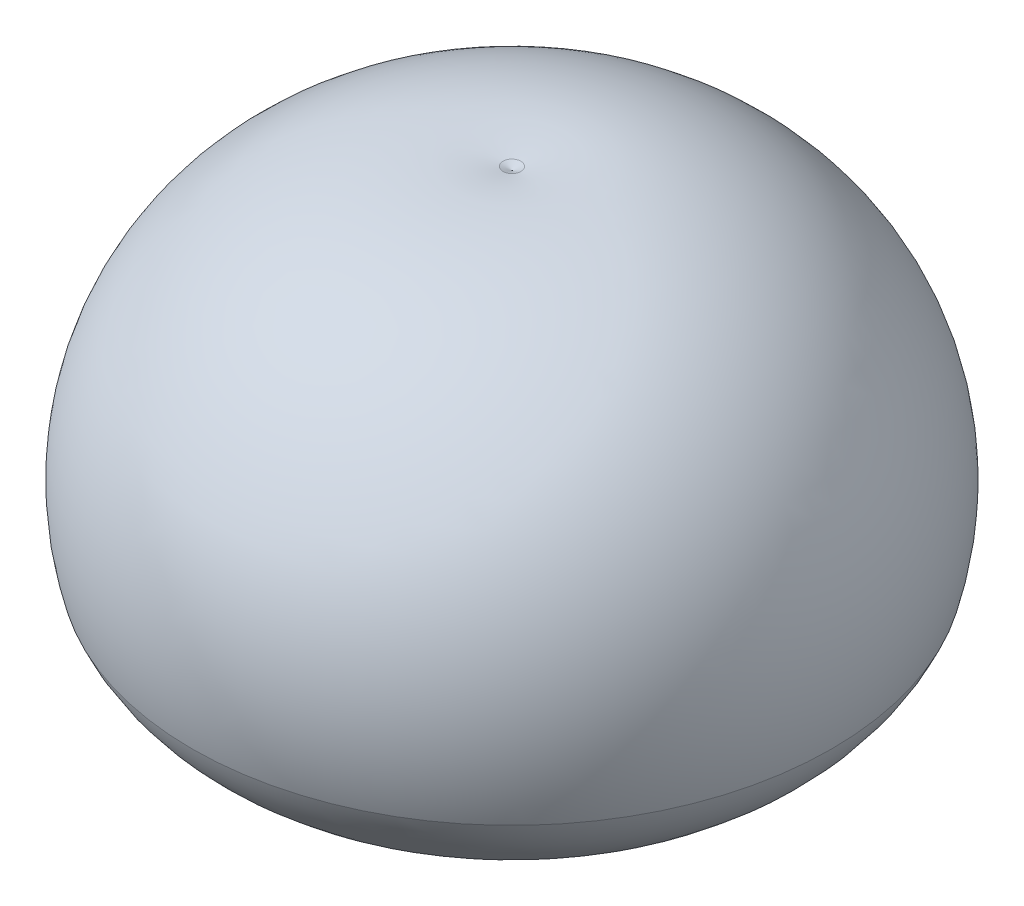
ISO-10303-21;
HEADER;
FILE_DESCRIPTION(('STEP AP214'),'2;1');
FILE_NAME('part.step','',(''),(''),'','','');
FILE_SCHEMA(('AUTOMOTIVE_DESIGN { 1 0 10303 214 1 1 1 1 }'));
ENDSEC;
DATA;
#1=APPLICATION_CONTEXT('core data for automotive mechanical design processes');
#2=APPLICATION_PROTOCOL_DEFINITION('international standard','automotive_design',2000,#1);
#3=PRODUCT_CONTEXT('',#1,'mechanical');
#4=PRODUCT('Part','Part','',(#3));
#5=PRODUCT_RELATED_PRODUCT_CATEGORY('part','',(#4));
#6=PRODUCT_DEFINITION_FORMATION('','',#4);
#7=PRODUCT_DEFINITION_CONTEXT('part definition',#1,'design');
#8=PRODUCT_DEFINITION('design','',#6,#7);
#9=PRODUCT_DEFINITION_SHAPE('','',#8);
#10=(LENGTH_UNIT() NAMED_UNIT(*) SI_UNIT(.MILLI.,.METRE.));
#11=(NAMED_UNIT(*) PLANE_ANGLE_UNIT() SI_UNIT($,.RADIAN.));
#12=(NAMED_UNIT(*) SI_UNIT($,.STERADIAN.) SOLID_ANGLE_UNIT());
#13=UNCERTAINTY_MEASURE_WITH_UNIT(LENGTH_MEASURE(1.E-05),#10,'distance_accuracy_value','');
#14=(GEOMETRIC_REPRESENTATION_CONTEXT(3) GLOBAL_UNCERTAINTY_ASSIGNED_CONTEXT((#13)) GLOBAL_UNIT_ASSIGNED_CONTEXT((#10,
#11,#12)) REPRESENTATION_CONTEXT('',''));
#15=CARTESIAN_POINT('',(0.,0.,0.));
#16=DIRECTION('',(0.,0.,1.));
#17=DIRECTION('',(1.,0.,0.));
#18=AXIS2_PLACEMENT_3D('',#15,#16,#17);
#19=CARTESIAN_POINT('',(356.098188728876,2020.71307667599,0.));
#20=DIRECTION('',(0.,0.,-1.));
#21=DIRECTION('',(1.,0.,0.));
#22=AXIS2_PLACEMENT_3D('',#19,#20,#21);
#23=CIRCLE('',#22,849.999999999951);
#24=TRIMMED_CURVE('',#23,(PARAMETER_VALUE(-2.0030728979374)),(PARAMETER_VALUE(2.0030728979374)),
.T.,.PARAMETER.);
#25=CARTESIAN_POINT('',(-1.66533453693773E-13,2020.71307667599,0.));
#26=DIRECTION('',(0.,-1.,0.));
#27=AXIS1_PLACEMENT('',#25,#26);
#28=SURFACE_OF_REVOLUTION('',#24,#27);
#29=CARTESIAN_POINT('',(-2.1690946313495E-13,2819.45180434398,0.));
#30=DIRECTION('',(0.,-1.,0.));
#31=DIRECTION('',(1.,0.,0.));
#32=AXIS2_PLACEMENT_3D('',#29,#30,#31);
#33=CIRCLE('',#32,65.3810669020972);
#34=CARTESIAN_POINT('',(65.381066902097,2819.45180434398,0.));
#35=VERTEX_POINT('',#34);
#36=EDGE_CURVE('E10',#35,#35,#33,.T.);
#37=ORIENTED_EDGE('',*,*,#36,.F.);
#38=EDGE_LOOP('',(#37));
#39=FACE_BOUND('',#38,.T.);
#40=CARTESIAN_POINT('',(0.,2792.5252818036,0.));
#41=VERTEX_POINT('',#40);
#42=VERTEX_LOOP('',#41);
#43=FACE_BOUND('',#42,.T.);
#44=ADVANCED_FACE('F16',(#39,#43),#28,.T.);
#45=CARTESIAN_POINT('',(0.,830.,0.));
#46=DIRECTION('',(0.,-1.,0.));
#47=DIRECTION('',(1.,0.,0.));
#48=AXIS2_PLACEMENT_3D('',#45,#46,#47);
#49=DEGENERATE_TOROIDAL_SURFACE('',#48,400.,2017.39641919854,.T.);
#50=CARTESIAN_POINT('',(0.,292.489081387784,0.));
#51=DIRECTION('',(0.,-1.,0.));
#52=DIRECTION('',(1.,0.,0.));
#53=AXIS2_PLACEMENT_3D('',#50,#51,#52);
#54=CIRCLE('',#53,2344.47173406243);
#55=CARTESIAN_POINT('',(2344.47173406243,292.489081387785,0.));
#56=VERTEX_POINT('',#55);
#57=EDGE_CURVE('E23',#56,#56,#54,.T.);
#58=ORIENTED_EDGE('',*,*,#57,.F.);
#59=EDGE_LOOP('',(#58));
#60=FACE_BOUND('',#59,.T.);
#61=ORIENTED_EDGE('',*,*,#36,.T.);
#62=EDGE_LOOP('',(#61));
#63=FACE_BOUND('',#62,.T.);
#64=ADVANCED_FACE('F50',(#60,#63),#49,.T.);
#65=CARTESIAN_POINT('',(0.,755.917618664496,0.));
#66=DIRECTION('',(0.,-1.,0.));
#67=DIRECTION('',(1.,0.,0.));
#68=AXIS2_PLACEMENT_3D('',#65,#66,#67);
#69=TOROIDAL_SURFACE('',#68,1246.76549337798,1191.52213575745);
#70=CARTESIAN_POINT('',(0.,-244.638476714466,0.));
#71=DIRECTION('',(0.,-1.,0.));
#72=DIRECTION('',(1.,0.,0.));
#73=AXIS2_PLACEMENT_3D('',#70,#71,#72);
#74=CIRCLE('',#73,599.762788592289);
#75=CARTESIAN_POINT('',(599.762788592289,-244.638476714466,0.));
#76=VERTEX_POINT('',#75);
#77=EDGE_CURVE('E41',#76,#76,#74,.T.);
#78=ORIENTED_EDGE('',*,*,#77,.F.);
#79=EDGE_LOOP('',(#78));
#80=FACE_BOUND('',#79,.T.);
#81=ORIENTED_EDGE('',*,*,#57,.T.);
#82=EDGE_LOOP('',(#81));
#83=FACE_BOUND('',#82,.T.);
#84=ADVANCED_FACE('F48',(#80,#83),#69,.T.);
#85=CARTESIAN_POINT('',(0.,0.,0.));
#86=DIRECTION('',(0.,-1.,0.));
#87=DIRECTION('',(1.,0.,0.));
#88=AXIS2_PLACEMENT_3D('',#85,#86,#87);
#89=CYLINDRICAL_SURFACE('',#88,599.762788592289);
#90=CARTESIAN_POINT('',(0.,223.298463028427,0.));
#91=DIRECTION('',(0.,-1.,0.));
#92=DIRECTION('',(1.,0.,0.));
#93=AXIS2_PLACEMENT_3D('',#90,#91,#92);
#94=CIRCLE('',#93,599.762788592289);
#95=CARTESIAN_POINT('',(599.762788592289,223.298463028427,0.));
#96=VERTEX_POINT('',#95);
#97=EDGE_CURVE('E38',#96,#96,#94,.T.);
#98=ORIENTED_EDGE('',*,*,#97,.F.);
#99=EDGE_LOOP('',(#98));
#100=FACE_BOUND('',#99,.T.);
#101=ORIENTED_EDGE('',*,*,#77,.T.);
#102=EDGE_LOOP('',(#101));
#103=FACE_BOUND('',#102,.T.);
#104=ADVANCED_FACE('F76',(#100,#103),#89,.F.);
#105=CARTESIAN_POINT('',(0.,830.,0.));
#106=DIRECTION('',(0.,-1.,0.));
#107=DIRECTION('',(1.,0.,0.));
#108=AXIS2_PLACEMENT_3D('',#105,#106,#107);
#109=DEGENERATE_TOROIDAL_SURFACE('',#108,400.,638.742457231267,.T.);
#110=CARTESIAN_POINT('',(-1.06218097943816E-13,1380.653492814,0.));
#111=DIRECTION('',(0.,-1.,0.));
#112=DIRECTION('',(1.,0.,0.));
#113=AXIS2_PLACEMENT_3D('',#110,#111,#112);
#114=CIRCLE('',#113,723.686047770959);
#115=CARTESIAN_POINT('',(723.686047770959,1380.653492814,0.));
#116=VERTEX_POINT('',#115);
#117=EDGE_CURVE('E36',#116,#116,#114,.T.);
#118=ORIENTED_EDGE('',*,*,#117,.F.);
#119=EDGE_LOOP('',(#118));
#120=FACE_BOUND('',#119,.T.);
#121=ORIENTED_EDGE('',*,*,#97,.T.);
#122=EDGE_LOOP('',(#121));
#123=FACE_BOUND('',#122,.T.);
#124=ADVANCED_FACE('F32',(#120,#123),#109,.F.);
#125=CARTESIAN_POINT('',(-421.036952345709,1049.99618833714,0.));
#126=DIRECTION('',(0.,0.,-1.));
#127=DIRECTION('',(1.,0.,0.));
#128=AXIS2_PLACEMENT_3D('',#125,#126,#127);
#129=CIRCLE('',#128,1191.52213575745);
#130=TRIMMED_CURVE('',#129,(PARAMETER_VALUE(-1.20963531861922)),
(PARAMETER_VALUE(1.20963531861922)),.T.,.PARAMETER.);
#131=CARTESIAN_POINT('',(0.,1049.99618833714,0.));
#132=DIRECTION('',(0.,-1.,0.));
#133=AXIS1_PLACEMENT('',#131,#132);
#134=SURFACE_OF_REVOLUTION('',#130,#133);
#135=CARTESIAN_POINT('',(-2.22044604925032E-13,2164.64989454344,0.));
#136=VERTEX_POINT('',#135);
#137=VERTEX_LOOP('',#136);
#138=FACE_BOUND('',#137,.T.);
#139=ORIENTED_EDGE('',*,*,#117,.T.);
#140=EDGE_LOOP('',(#139));
#141=FACE_BOUND('',#140,.T.);
#142=ADVANCED_FACE('F29',(#138,#141),#134,.F.);
#143=CLOSED_SHELL('',(#44,#64,#84,#104,#124,#142));
#144=MANIFOLD_SOLID_BREP('B1',#143);
#145=ADVANCED_BREP_SHAPE_REPRESENTATION('',(#18,#144),#14);
#146=SHAPE_DEFINITION_REPRESENTATION(#9,#145);
ENDSEC;
END-ISO-10303-21;
